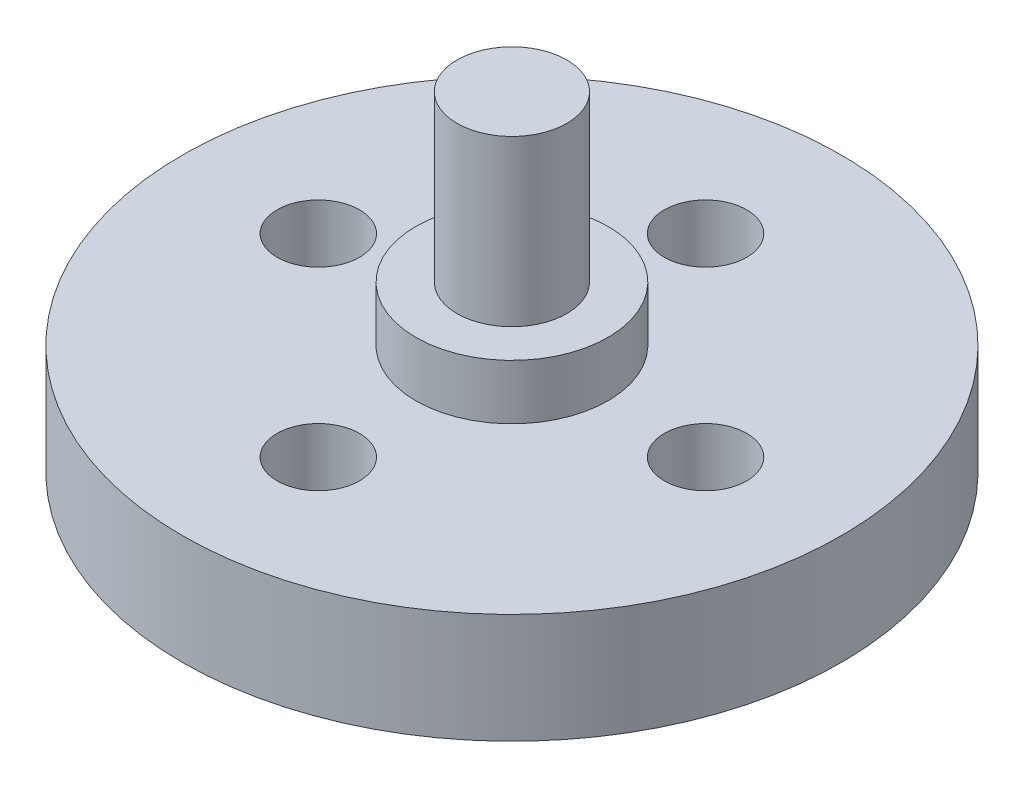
ISO-10303-21;
HEADER;
FILE_DESCRIPTION(('STEP AP214'),'2;1');
FILE_NAME('part.step','',(''),(''),'','','');
FILE_SCHEMA(('AUTOMOTIVE_DESIGN { 1 0 10303 214 1 1 1 1 }'));
ENDSEC;
DATA;
#1=APPLICATION_CONTEXT('core data for automotive mechanical design processes');
#2=APPLICATION_PROTOCOL_DEFINITION('international standard','automotive_design',2000,#1);
#3=PRODUCT_CONTEXT('',#1,'mechanical');
#4=PRODUCT('Part','Part','',(#3));
#5=PRODUCT_RELATED_PRODUCT_CATEGORY('part','',(#4));
#6=PRODUCT_DEFINITION_FORMATION('','',#4);
#7=PRODUCT_DEFINITION_CONTEXT('part definition',#1,'design');
#8=PRODUCT_DEFINITION('design','',#6,#7);
#9=PRODUCT_DEFINITION_SHAPE('','',#8);
#10=(LENGTH_UNIT() NAMED_UNIT(*) SI_UNIT(.MILLI.,.METRE.));
#11=(NAMED_UNIT(*) PLANE_ANGLE_UNIT() SI_UNIT($,.RADIAN.));
#12=(NAMED_UNIT(*) SI_UNIT($,.STERADIAN.) SOLID_ANGLE_UNIT());
#13=UNCERTAINTY_MEASURE_WITH_UNIT(LENGTH_MEASURE(1.E-05),#10,'distance_accuracy_value','');
#14=(GEOMETRIC_REPRESENTATION_CONTEXT(3) GLOBAL_UNCERTAINTY_ASSIGNED_CONTEXT((#13)) GLOBAL_UNIT_ASSIGNED_CONTEXT((#10,
#11,#12)) REPRESENTATION_CONTEXT('',''));
#15=CARTESIAN_POINT('',(0.,0.,0.));
#16=DIRECTION('',(0.,0.,1.));
#17=DIRECTION('',(1.,0.,0.));
#18=AXIS2_PLACEMENT_3D('',#15,#16,#17);
#19=CARTESIAN_POINT('',(0.,4.,0.));
#20=DIRECTION('',(0.,1.,0.));
#21=DIRECTION('',(0.,0.,1.));
#22=AXIS2_PLACEMENT_3D('',#19,#20,#21);
#23=PLANE('',#22);
#24=CARTESIAN_POINT('',(0.,4.,0.));
#25=DIRECTION('',(0.,1.,0.));
#26=DIRECTION('',(0.,0.,1.));
#27=AXIS2_PLACEMENT_3D('',#24,#25,#26);
#28=CIRCLE('',#27,3.5);
#29=CARTESIAN_POINT('',(0.,4.,3.5));
#30=VERTEX_POINT('',#29);
#31=EDGE_CURVE('E74',#30,#30,#28,.T.);
#32=ORIENTED_EDGE('',*,*,#31,.F.);
#33=EDGE_LOOP('',(#32));
#34=FACE_BOUND('',#33,.T.);
#35=CARTESIAN_POINT('',(3.99019350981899E-13,4.,7.05));
#36=DIRECTION('',(0.,1.,0.));
#37=DIRECTION('',(0.,0.,1.));
#38=AXIS2_PLACEMENT_3D('',#35,#36,#37);
#39=CIRCLE('',#38,1.50000000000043);
#40=CARTESIAN_POINT('',(3.99019350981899E-13,4.,8.55000000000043));
#41=VERTEX_POINT('',#40);
#42=EDGE_CURVE('E57',#41,#41,#39,.T.);
#43=ORIENTED_EDGE('',*,*,#42,.F.);
#44=EDGE_LOOP('',(#43));
#45=FACE_BOUND('',#44,.T.);
#46=CARTESIAN_POINT('',(0.,4.,-7.05));
#47=DIRECTION('',(0.,1.,0.));
#48=DIRECTION('',(0.,0.,1.));
#49=AXIS2_PLACEMENT_3D('',#46,#47,#48);
#50=CIRCLE('',#49,1.5);
#51=CARTESIAN_POINT('',(0.,4.,-5.55));
#52=VERTEX_POINT('',#51);
#53=EDGE_CURVE('E46',#52,#52,#50,.T.);
#54=ORIENTED_EDGE('',*,*,#53,.F.);
#55=EDGE_LOOP('',(#54));
#56=FACE_BOUND('',#55,.T.);
#57=CARTESIAN_POINT('',(0.,4.,0.));
#58=DIRECTION('',(0.,1.,0.));
#59=DIRECTION('',(0.,0.,1.));
#60=AXIS2_PLACEMENT_3D('',#57,#58,#59);
#61=CIRCLE('',#60,12.);
#62=CARTESIAN_POINT('',(0.,4.,12.));
#63=VERTEX_POINT('',#62);
#64=EDGE_CURVE('E10',#63,#63,#61,.T.);
#65=ORIENTED_EDGE('',*,*,#64,.T.);
#66=EDGE_LOOP('',(#65));
#67=FACE_BOUND('',#66,.T.);
#68=CARTESIAN_POINT('',(7.0500000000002,4.,-1.99509675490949E-13));
#69=DIRECTION('',(0.,1.,0.));
#70=DIRECTION('',(0.,0.,1.));
#71=AXIS2_PLACEMENT_3D('',#68,#69,#70);
#72=CIRCLE('',#71,1.50000000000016);
#73=CARTESIAN_POINT('',(7.0500000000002,4.,1.49999999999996));
#74=VERTEX_POINT('',#73);
#75=EDGE_CURVE('E51',#74,#74,#72,.T.);
#76=ORIENTED_EDGE('',*,*,#75,.F.);
#77=EDGE_LOOP('',(#76));
#78=FACE_BOUND('',#77,.T.);
#79=CARTESIAN_POINT('',(-7.0499999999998,4.,2.00373051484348E-13));
#80=DIRECTION('',(0.,1.,0.));
#81=DIRECTION('',(0.,0.,1.));
#82=AXIS2_PLACEMENT_3D('',#79,#80,#81);
#83=CIRCLE('',#82,1.50000000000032);
#84=CARTESIAN_POINT('',(-7.0499999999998,4.,1.50000000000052));
#85=VERTEX_POINT('',#84);
#86=EDGE_CURVE('E63',#85,#85,#83,.T.);
#87=ORIENTED_EDGE('',*,*,#86,.F.);
#88=EDGE_LOOP('',(#87));
#89=FACE_BOUND('',#88,.T.);
#90=ADVANCED_FACE('F33',(#34,#45,#56,#67,#78,#89),#23,.T.);
#91=CARTESIAN_POINT('',(0.,0.,0.));
#92=DIRECTION('',(0.,1.,0.));
#93=DIRECTION('',(0.,0.,1.));
#94=AXIS2_PLACEMENT_3D('',#91,#92,#93);
#95=PLANE('',#94);
#96=CARTESIAN_POINT('',(0.,0.,0.));
#97=DIRECTION('',(0.,1.,0.));
#98=DIRECTION('',(0.,0.,1.));
#99=AXIS2_PLACEMENT_3D('',#96,#97,#98);
#100=CIRCLE('',#99,12.);
#101=CARTESIAN_POINT('',(0.,0.,12.));
#102=VERTEX_POINT('',#101);
#103=EDGE_CURVE('E41',#102,#102,#100,.T.);
#104=ORIENTED_EDGE('',*,*,#103,.F.);
#105=EDGE_LOOP('',(#104));
#106=FACE_BOUND('',#105,.T.);
#107=CARTESIAN_POINT('',(0.,0.,-7.05));
#108=DIRECTION('',(0.,1.,0.));
#109=DIRECTION('',(0.,0.,1.));
#110=AXIS2_PLACEMENT_3D('',#107,#108,#109);
#111=CIRCLE('',#110,1.5);
#112=CARTESIAN_POINT('',(0.,0.,-5.55));
#113=VERTEX_POINT('',#112);
#114=EDGE_CURVE('E48',#113,#113,#111,.T.);
#115=ORIENTED_EDGE('',*,*,#114,.T.);
#116=EDGE_LOOP('',(#115));
#117=FACE_BOUND('',#116,.T.);
#118=CARTESIAN_POINT('',(7.0500000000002,0.,-1.99509675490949E-13));
#119=DIRECTION('',(0.,1.,0.));
#120=DIRECTION('',(0.,0.,1.));
#121=AXIS2_PLACEMENT_3D('',#118,#119,#120);
#122=CIRCLE('',#121,1.50000000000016);
#123=CARTESIAN_POINT('',(7.0500000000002,0.,1.49999999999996));
#124=VERTEX_POINT('',#123);
#125=EDGE_CURVE('E54',#124,#124,#122,.T.);
#126=ORIENTED_EDGE('',*,*,#125,.T.);
#127=EDGE_LOOP('',(#126));
#128=FACE_BOUND('',#127,.T.);
#129=CARTESIAN_POINT('',(3.99019350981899E-13,0.,7.05));
#130=DIRECTION('',(0.,1.,0.));
#131=DIRECTION('',(0.,0.,1.));
#132=AXIS2_PLACEMENT_3D('',#129,#130,#131);
#133=CIRCLE('',#132,1.50000000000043);
#134=CARTESIAN_POINT('',(3.99019350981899E-13,0.,8.55000000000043));
#135=VERTEX_POINT('',#134);
#136=EDGE_CURVE('E60',#135,#135,#133,.T.);
#137=ORIENTED_EDGE('',*,*,#136,.T.);
#138=EDGE_LOOP('',(#137));
#139=FACE_BOUND('',#138,.T.);
#140=CARTESIAN_POINT('',(-7.0499999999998,0.,2.00373051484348E-13));
#141=DIRECTION('',(0.,1.,0.));
#142=DIRECTION('',(0.,0.,1.));
#143=AXIS2_PLACEMENT_3D('',#140,#141,#142);
#144=CIRCLE('',#143,1.50000000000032);
#145=CARTESIAN_POINT('',(-7.0499999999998,0.,1.50000000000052));
#146=VERTEX_POINT('',#145);
#147=EDGE_CURVE('E66',#146,#146,#144,.T.);
#148=ORIENTED_EDGE('',*,*,#147,.T.);
#149=EDGE_LOOP('',(#148));
#150=FACE_BOUND('',#149,.T.);
#151=ADVANCED_FACE('F102',(#106,#117,#128,#139,#150),#95,.F.);
#152=CARTESIAN_POINT('',(0.,4.,0.));
#153=DIRECTION('',(0.,-1.,0.));
#154=DIRECTION('',(0.,0.,-1.));
#155=AXIS2_PLACEMENT_3D('',#152,#153,#154);
#156=CYLINDRICAL_SURFACE('',#155,12.);
#157=ORIENTED_EDGE('',*,*,#64,.F.);
#158=EDGE_LOOP('',(#157));
#159=FACE_BOUND('',#158,.T.);
#160=ORIENTED_EDGE('',*,*,#103,.T.);
#161=EDGE_LOOP('',(#160));
#162=FACE_BOUND('',#161,.T.);
#163=ADVANCED_FACE('F35',(#159,#162),#156,.T.);
#164=CARTESIAN_POINT('',(0.,4.,-7.05));
#165=DIRECTION('',(0.,-1.,0.));
#166=DIRECTION('',(0.,0.,-1.));
#167=AXIS2_PLACEMENT_3D('',#164,#165,#166);
#168=CYLINDRICAL_SURFACE('',#167,1.5);
#169=ORIENTED_EDGE('',*,*,#53,.T.);
#170=EDGE_LOOP('',(#169));
#171=FACE_BOUND('',#170,.T.);
#172=ORIENTED_EDGE('',*,*,#114,.F.);
#173=EDGE_LOOP('',(#172));
#174=FACE_BOUND('',#173,.T.);
#175=ADVANCED_FACE('F112',(#171,#174),#168,.F.);
#176=CARTESIAN_POINT('',(7.0500000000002,4.,-1.99509675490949E-13));
#177=DIRECTION('',(0.,-1.,0.));
#178=DIRECTION('',(0.,0.,-1.));
#179=AXIS2_PLACEMENT_3D('',#176,#177,#178);
#180=CYLINDRICAL_SURFACE('',#179,1.50000000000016);
#181=ORIENTED_EDGE('',*,*,#75,.T.);
#182=EDGE_LOOP('',(#181));
#183=FACE_BOUND('',#182,.T.);
#184=ORIENTED_EDGE('',*,*,#125,.F.);
#185=EDGE_LOOP('',(#184));
#186=FACE_BOUND('',#185,.T.);
#187=ADVANCED_FACE('F115',(#183,#186),#180,.F.);
#188=CARTESIAN_POINT('',(3.99019350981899E-13,4.,7.05));
#189=DIRECTION('',(0.,-1.,0.));
#190=DIRECTION('',(0.,0.,-1.));
#191=AXIS2_PLACEMENT_3D('',#188,#189,#190);
#192=CYLINDRICAL_SURFACE('',#191,1.50000000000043);
#193=ORIENTED_EDGE('',*,*,#42,.T.);
#194=EDGE_LOOP('',(#193));
#195=FACE_BOUND('',#194,.T.);
#196=ORIENTED_EDGE('',*,*,#136,.F.);
#197=EDGE_LOOP('',(#196));
#198=FACE_BOUND('',#197,.T.);
#199=ADVANCED_FACE('F119',(#195,#198),#192,.F.);
#200=CARTESIAN_POINT('',(-7.0499999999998,4.,2.00373051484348E-13));
#201=DIRECTION('',(0.,-1.,0.));
#202=DIRECTION('',(0.,0.,-1.));
#203=AXIS2_PLACEMENT_3D('',#200,#201,#202);
#204=CYLINDRICAL_SURFACE('',#203,1.50000000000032);
#205=ORIENTED_EDGE('',*,*,#86,.T.);
#206=EDGE_LOOP('',(#205));
#207=FACE_BOUND('',#206,.T.);
#208=ORIENTED_EDGE('',*,*,#147,.F.);
#209=EDGE_LOOP('',(#208));
#210=FACE_BOUND('',#209,.T.);
#211=ADVANCED_FACE('F98',(#207,#210),#204,.F.);
#212=CARTESIAN_POINT('',(0.,6.,0.));
#213=DIRECTION('',(0.,-1.,0.));
#214=DIRECTION('',(0.,0.,-1.));
#215=AXIS2_PLACEMENT_3D('',#212,#213,#214);
#216=CYLINDRICAL_SURFACE('',#215,3.5);
#217=CARTESIAN_POINT('',(0.,6.,0.));
#218=DIRECTION('',(0.,1.,0.));
#219=DIRECTION('',(0.,0.,1.));
#220=AXIS2_PLACEMENT_3D('',#217,#218,#219);
#221=CIRCLE('',#220,3.5);
#222=CARTESIAN_POINT('',(0.,6.,3.5));
#223=VERTEX_POINT('',#222);
#224=EDGE_CURVE('E77',#223,#223,#221,.T.);
#225=ORIENTED_EDGE('',*,*,#224,.F.);
#226=EDGE_LOOP('',(#225));
#227=FACE_BOUND('',#226,.T.);
#228=ORIENTED_EDGE('',*,*,#31,.T.);
#229=EDGE_LOOP('',(#228));
#230=FACE_BOUND('',#229,.T.);
#231=ADVANCED_FACE('F90',(#227,#230),#216,.T.);
#232=CARTESIAN_POINT('',(0.,6.,0.));
#233=DIRECTION('',(0.,1.,0.));
#234=DIRECTION('',(0.,0.,1.));
#235=AXIS2_PLACEMENT_3D('',#232,#233,#234);
#236=PLANE('',#235);
#237=CARTESIAN_POINT('',(0.,6.,0.));
#238=DIRECTION('',(0.,1.,0.));
#239=DIRECTION('',(0.,0.,1.));
#240=AXIS2_PLACEMENT_3D('',#237,#238,#239);
#241=CIRCLE('',#240,2.);
#242=CARTESIAN_POINT('',(0.,6.,2.));
#243=VERTEX_POINT('',#242);
#244=EDGE_CURVE('E37',#243,#243,#241,.T.);
#245=ORIENTED_EDGE('',*,*,#244,.F.);
#246=EDGE_LOOP('',(#245));
#247=FACE_BOUND('',#246,.T.);
#248=ORIENTED_EDGE('',*,*,#224,.T.);
#249=EDGE_LOOP('',(#248));
#250=FACE_BOUND('',#249,.T.);
#251=ADVANCED_FACE('F87',(#247,#250),#236,.T.);
#252=CARTESIAN_POINT('',(0.,12.,0.));
#253=DIRECTION('',(0.,1.,0.));
#254=DIRECTION('',(0.,0.,1.));
#255=AXIS2_PLACEMENT_3D('',#252,#253,#254);
#256=PLANE('',#255);
#257=CARTESIAN_POINT('',(0.,12.,0.));
#258=DIRECTION('',(0.,1.,0.));
#259=DIRECTION('',(0.,0.,1.));
#260=AXIS2_PLACEMENT_3D('',#257,#258,#259);
#261=CIRCLE('',#260,2.);
#262=CARTESIAN_POINT('',(0.,12.,2.));
#263=VERTEX_POINT('',#262);
#264=EDGE_CURVE('E69',#263,#263,#261,.T.);
#265=ORIENTED_EDGE('',*,*,#264,.T.);
#266=EDGE_LOOP('',(#265));
#267=FACE_BOUND('',#266,.T.);
#268=ADVANCED_FACE('F89',(#267),#256,.T.);
#269=CARTESIAN_POINT('',(0.,12.,0.));
#270=DIRECTION('',(0.,-1.,0.));
#271=DIRECTION('',(0.,0.,-1.));
#272=AXIS2_PLACEMENT_3D('',#269,#270,#271);
#273=CYLINDRICAL_SURFACE('',#272,2.);
#274=ORIENTED_EDGE('',*,*,#244,.T.);
#275=EDGE_LOOP('',(#274));
#276=FACE_BOUND('',#275,.T.);
#277=ORIENTED_EDGE('',*,*,#264,.F.);
#278=EDGE_LOOP('',(#277));
#279=FACE_BOUND('',#278,.T.);
#280=ADVANCED_FACE('F84',(#276,#279),#273,.T.);
#281=CLOSED_SHELL('',(#90,#151,#163,#175,#187,#199,#211,#231,#251,#268,#280));
#282=MANIFOLD_SOLID_BREP('B2',#281);
#283=ADVANCED_BREP_SHAPE_REPRESENTATION('',(#18,#282),#14);
#284=SHAPE_DEFINITION_REPRESENTATION(#9,#283);
ENDSEC;
END-ISO-10303-21;
